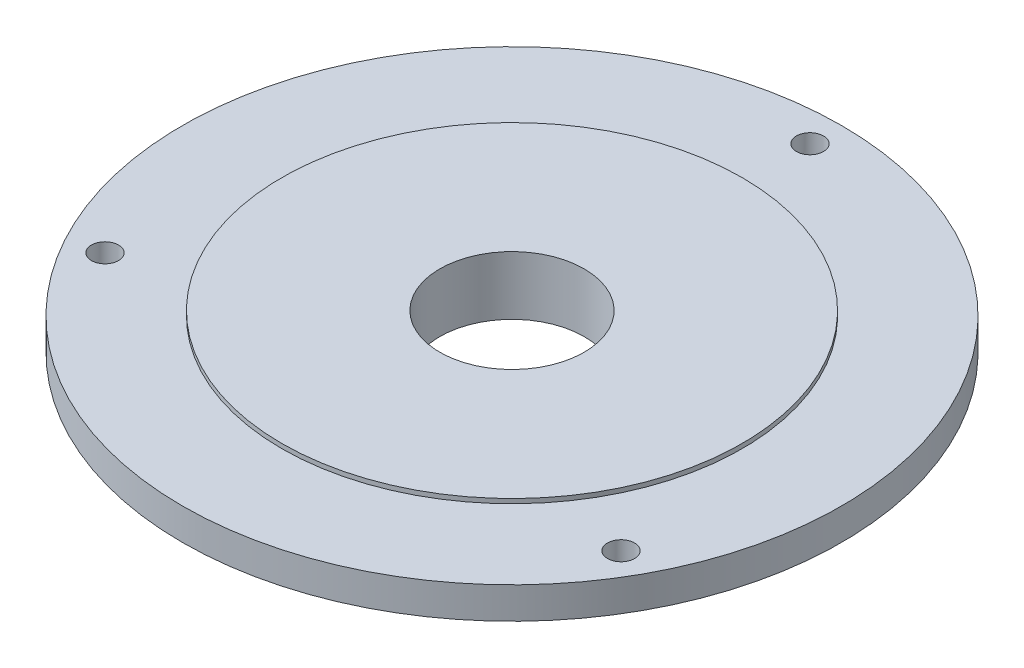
ISO-10303-21;
HEADER;
FILE_DESCRIPTION(('STEP AP214'),'2;1');
FILE_NAME('part.step','',(''),(''),'','','');
FILE_SCHEMA(('AUTOMOTIVE_DESIGN { 1 0 10303 214 1 1 1 1 }'));
ENDSEC;
DATA;
#1=APPLICATION_CONTEXT('core data for automotive mechanical design processes');
#2=APPLICATION_PROTOCOL_DEFINITION('international standard','automotive_design',2000,#1);
#3=PRODUCT_CONTEXT('',#1,'mechanical');
#4=PRODUCT('Part','Part','',(#3));
#5=PRODUCT_RELATED_PRODUCT_CATEGORY('part','',(#4));
#6=PRODUCT_DEFINITION_FORMATION('','',#4);
#7=PRODUCT_DEFINITION_CONTEXT('part definition',#1,'design');
#8=PRODUCT_DEFINITION('design','',#6,#7);
#9=PRODUCT_DEFINITION_SHAPE('','',#8);
#10=(LENGTH_UNIT() NAMED_UNIT(*) SI_UNIT(.MILLI.,.METRE.));
#11=(NAMED_UNIT(*) PLANE_ANGLE_UNIT() SI_UNIT($,.RADIAN.));
#12=(NAMED_UNIT(*) SI_UNIT($,.STERADIAN.) SOLID_ANGLE_UNIT());
#13=UNCERTAINTY_MEASURE_WITH_UNIT(LENGTH_MEASURE(1.E-05),#10,'distance_accuracy_value','');
#14=(GEOMETRIC_REPRESENTATION_CONTEXT(3) GLOBAL_UNCERTAINTY_ASSIGNED_CONTEXT((#13)) GLOBAL_UNIT_ASSIGNED_CONTEXT((#10,
#11,#12)) REPRESENTATION_CONTEXT('',''));
#15=CARTESIAN_POINT('',(0.,0.,0.));
#16=DIRECTION('',(0.,0.,1.));
#17=DIRECTION('',(1.,0.,0.));
#18=AXIS2_PLACEMENT_3D('',#15,#16,#17);
#19=CARTESIAN_POINT('',(0.,0.,0.));
#20=DIRECTION('',(0.,-1.,0.));
#21=DIRECTION('',(0.,0.,-1.));
#22=AXIS2_PLACEMENT_3D('',#19,#20,#21);
#23=CYLINDRICAL_SURFACE('',#22,25.5);
#24=CARTESIAN_POINT('',(0.,38.3859311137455,0.));
#25=DIRECTION('',(0.,-1.,0.));
#26=DIRECTION('',(0.,0.,-1.));
#27=AXIS2_PLACEMENT_3D('',#24,#25,#26);
#28=CIRCLE('',#27,25.5);
#29=CARTESIAN_POINT('',(0.,38.3859311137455,-25.5));
#30=VERTEX_POINT('',#29);
#31=EDGE_CURVE('E10',#30,#30,#28,.T.);
#32=ORIENTED_EDGE('',*,*,#31,.T.);
#33=EDGE_LOOP('',(#32));
#34=FACE_BOUND('',#33,.T.);
#35=CARTESIAN_POINT('',(0.,37.8859311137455,0.));
#36=DIRECTION('',(0.,-1.,0.));
#37=DIRECTION('',(0.,0.,-1.));
#38=AXIS2_PLACEMENT_3D('',#35,#36,#37);
#39=CIRCLE('',#38,25.5);
#40=CARTESIAN_POINT('',(0.,37.8859311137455,-25.5));
#41=VERTEX_POINT('',#40);
#42=EDGE_CURVE('E67',#41,#41,#39,.T.);
#43=ORIENTED_EDGE('',*,*,#42,.F.);
#44=EDGE_LOOP('',(#43));
#45=FACE_BOUND('',#44,.T.);
#46=ADVANCED_FACE('F39',(#34,#45),#23,.T.);
#47=CARTESIAN_POINT('',(8.,38.3859311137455,0.));
#48=DIRECTION('',(0.,1.,0.));
#49=DIRECTION('',(0.,0.,1.));
#50=AXIS2_PLACEMENT_3D('',#47,#48,#49);
#51=PLANE('',#50);
#52=CARTESIAN_POINT('',(0.,38.3859311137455,0.));
#53=DIRECTION('',(0.,-1.,0.));
#54=DIRECTION('',(0.,0.,-1.));
#55=AXIS2_PLACEMENT_3D('',#52,#53,#54);
#56=CIRCLE('',#55,8.);
#57=CARTESIAN_POINT('',(0.,38.3859311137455,-8.));
#58=VERTEX_POINT('',#57);
#59=EDGE_CURVE('E45',#58,#58,#56,.T.);
#60=ORIENTED_EDGE('',*,*,#59,.T.);
#61=EDGE_LOOP('',(#60));
#62=FACE_BOUND('',#61,.T.);
#63=ORIENTED_EDGE('',*,*,#31,.F.);
#64=EDGE_LOOP('',(#63));
#65=FACE_BOUND('',#64,.T.);
#66=ADVANCED_FACE('F132',(#62,#65),#51,.T.);
#67=CARTESIAN_POINT('',(0.,0.,0.));
#68=DIRECTION('',(0.,-1.,0.));
#69=DIRECTION('',(0.,0.,-1.));
#70=AXIS2_PLACEMENT_3D('',#67,#68,#69);
#71=CYLINDRICAL_SURFACE('',#70,8.);
#72=CARTESIAN_POINT('',(0.,31.8859311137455,0.));
#73=DIRECTION('',(0.,-1.,0.));
#74=DIRECTION('',(0.,0.,-1.));
#75=AXIS2_PLACEMENT_3D('',#72,#73,#74);
#76=CIRCLE('',#75,8.);
#77=CARTESIAN_POINT('',(0.,31.8859311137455,-8.));
#78=VERTEX_POINT('',#77);
#79=EDGE_CURVE('E49',#78,#78,#76,.T.);
#80=ORIENTED_EDGE('',*,*,#79,.T.);
#81=EDGE_LOOP('',(#80));
#82=FACE_BOUND('',#81,.T.);
#83=ORIENTED_EDGE('',*,*,#59,.F.);
#84=EDGE_LOOP('',(#83));
#85=FACE_BOUND('',#84,.T.);
#86=ADVANCED_FACE('F126',(#82,#85),#71,.F.);
#87=CARTESIAN_POINT('',(8.,31.8859311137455,0.));
#88=DIRECTION('',(0.,-1.,0.));
#89=DIRECTION('',(0.,0.,-1.));
#90=AXIS2_PLACEMENT_3D('',#87,#88,#89);
#91=PLANE('',#90);
#92=CARTESIAN_POINT('',(0.,31.8859311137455,0.));
#93=DIRECTION('',(0.,-1.,0.));
#94=DIRECTION('',(0.,0.,-1.));
#95=AXIS2_PLACEMENT_3D('',#92,#93,#94);
#96=CIRCLE('',#95,14.25);
#97=CARTESIAN_POINT('',(0.,31.8859311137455,-14.25));
#98=VERTEX_POINT('',#97);
#99=EDGE_CURVE('E53',#98,#98,#96,.T.);
#100=ORIENTED_EDGE('',*,*,#99,.T.);
#101=EDGE_LOOP('',(#100));
#102=FACE_BOUND('',#101,.T.);
#103=ORIENTED_EDGE('',*,*,#79,.F.);
#104=EDGE_LOOP('',(#103));
#105=FACE_BOUND('',#104,.T.);
#106=ADVANCED_FACE('F120',(#102,#105),#91,.T.);
#107=CARTESIAN_POINT('',(0.,0.,0.));
#108=DIRECTION('',(0.,-1.,0.));
#109=DIRECTION('',(0.,0.,-1.));
#110=AXIS2_PLACEMENT_3D('',#107,#108,#109);
#111=CYLINDRICAL_SURFACE('',#110,14.25);
#112=CARTESIAN_POINT('',(0.,34.3859311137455,0.));
#113=DIRECTION('',(0.,-1.,0.));
#114=DIRECTION('',(0.,0.,-1.));
#115=AXIS2_PLACEMENT_3D('',#112,#113,#114);
#116=CIRCLE('',#115,14.25);
#117=CARTESIAN_POINT('',(0.,34.3859311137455,-14.25));
#118=VERTEX_POINT('',#117);
#119=EDGE_CURVE('E58',#118,#118,#116,.T.);
#120=ORIENTED_EDGE('',*,*,#119,.T.);
#121=EDGE_LOOP('',(#120));
#122=FACE_BOUND('',#121,.T.);
#123=ORIENTED_EDGE('',*,*,#99,.F.);
#124=EDGE_LOOP('',(#123));
#125=FACE_BOUND('',#124,.T.);
#126=ADVANCED_FACE('F113',(#122,#125),#111,.T.);
#127=CARTESIAN_POINT('',(14.25,34.3859311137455,0.));
#128=DIRECTION('',(0.,-1.,0.));
#129=DIRECTION('',(0.,0.,-1.));
#130=AXIS2_PLACEMENT_3D('',#127,#128,#129);
#131=PLANE('',#130);
#132=CARTESIAN_POINT('',(0.,34.3859311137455,-33.));
#133=DIRECTION('',(0.,-1.,0.));
#134=DIRECTION('',(0.,0.,-1.));
#135=AXIS2_PLACEMENT_3D('',#132,#133,#134);
#136=CIRCLE('',#135,1.5);
#137=CARTESIAN_POINT('',(0.,34.3859311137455,-34.5));
#138=VERTEX_POINT('',#137);
#139=EDGE_CURVE('E70',#138,#138,#136,.T.);
#140=ORIENTED_EDGE('',*,*,#139,.F.);
#141=EDGE_LOOP('',(#140));
#142=FACE_BOUND('',#141,.T.);
#143=CARTESIAN_POINT('',(28.5788383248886,34.3859311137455,16.4999999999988));
#144=DIRECTION('',(0.,-1.,0.));
#145=DIRECTION('',(0.,0.,-1.));
#146=AXIS2_PLACEMENT_3D('',#143,#144,#145);
#147=CIRCLE('',#146,1.5000000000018);
#148=CARTESIAN_POINT('',(28.5788383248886,34.3859311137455,14.999999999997));
#149=VERTEX_POINT('',#148);
#150=EDGE_CURVE('E73',#149,#149,#147,.T.);
#151=ORIENTED_EDGE('',*,*,#150,.F.);
#152=EDGE_LOOP('',(#151));
#153=FACE_BOUND('',#152,.T.);
#154=CARTESIAN_POINT('',(-28.5788383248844,34.3859311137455,16.5000000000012));
#155=DIRECTION('',(0.,-1.,0.));
#156=DIRECTION('',(0.,0.,-1.));
#157=AXIS2_PLACEMENT_3D('',#154,#155,#156);
#158=CIRCLE('',#157,1.50000000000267);
#159=CARTESIAN_POINT('',(-28.5788383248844,34.3859311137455,14.9999999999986));
#160=VERTEX_POINT('',#159);
#161=EDGE_CURVE('E76',#160,#160,#158,.T.);
#162=ORIENTED_EDGE('',*,*,#161,.F.);
#163=EDGE_LOOP('',(#162));
#164=FACE_BOUND('',#163,.T.);
#165=CARTESIAN_POINT('',(0.,34.3859311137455,0.));
#166=DIRECTION('',(0.,-1.,0.));
#167=DIRECTION('',(0.,0.,-1.));
#168=AXIS2_PLACEMENT_3D('',#165,#166,#167);
#169=CIRCLE('',#168,36.5);
#170=CARTESIAN_POINT('',(0.,34.3859311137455,-36.5));
#171=VERTEX_POINT('',#170);
#172=EDGE_CURVE('E61',#171,#171,#169,.T.);
#173=ORIENTED_EDGE('',*,*,#172,.T.);
#174=EDGE_LOOP('',(#173));
#175=FACE_BOUND('',#174,.T.);
#176=ORIENTED_EDGE('',*,*,#119,.F.);
#177=EDGE_LOOP('',(#176));
#178=FACE_BOUND('',#177,.T.);
#179=ADVANCED_FACE('F107',(#142,#153,#164,#175,#178),#131,.T.);
#180=CARTESIAN_POINT('',(0.,0.,0.));
#181=DIRECTION('',(0.,-1.,0.));
#182=DIRECTION('',(0.,0.,-1.));
#183=AXIS2_PLACEMENT_3D('',#180,#181,#182);
#184=CYLINDRICAL_SURFACE('',#183,36.5);
#185=CARTESIAN_POINT('',(0.,37.8859311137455,0.));
#186=DIRECTION('',(0.,-1.,0.));
#187=DIRECTION('',(0.,0.,-1.));
#188=AXIS2_PLACEMENT_3D('',#185,#186,#187);
#189=CIRCLE('',#188,36.5);
#190=CARTESIAN_POINT('',(0.,37.8859311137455,-36.5));
#191=VERTEX_POINT('',#190);
#192=EDGE_CURVE('E64',#191,#191,#189,.T.);
#193=ORIENTED_EDGE('',*,*,#192,.T.);
#194=EDGE_LOOP('',(#193));
#195=FACE_BOUND('',#194,.T.);
#196=ORIENTED_EDGE('',*,*,#172,.F.);
#197=EDGE_LOOP('',(#196));
#198=FACE_BOUND('',#197,.T.);
#199=ADVANCED_FACE('F95',(#195,#198),#184,.T.);
#200=CARTESIAN_POINT('',(25.5,37.8859311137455,0.));
#201=DIRECTION('',(0.,1.,0.));
#202=DIRECTION('',(0.,0.,1.));
#203=AXIS2_PLACEMENT_3D('',#200,#201,#202);
#204=PLANE('',#203);
#205=CARTESIAN_POINT('',(0.,37.8859311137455,-33.));
#206=DIRECTION('',(0.,1.,0.));
#207=DIRECTION('',(0.,0.,1.));
#208=AXIS2_PLACEMENT_3D('',#205,#206,#207);
#209=CIRCLE('',#208,1.5);
#210=CARTESIAN_POINT('',(0.,37.8859311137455,-31.5));
#211=VERTEX_POINT('',#210);
#212=EDGE_CURVE('E79',#211,#211,#209,.T.);
#213=ORIENTED_EDGE('',*,*,#212,.F.);
#214=EDGE_LOOP('',(#213));
#215=FACE_BOUND('',#214,.T.);
#216=CARTESIAN_POINT('',(28.5788383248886,37.8859311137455,16.4999999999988));
#217=DIRECTION('',(0.,1.,0.));
#218=DIRECTION('',(0.,0.,1.));
#219=AXIS2_PLACEMENT_3D('',#216,#217,#218);
#220=CIRCLE('',#219,1.5000000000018);
#221=CARTESIAN_POINT('',(28.5788383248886,37.8859311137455,18.0000000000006));
#222=VERTEX_POINT('',#221);
#223=EDGE_CURVE('E83',#222,#222,#220,.T.);
#224=ORIENTED_EDGE('',*,*,#223,.F.);
#225=EDGE_LOOP('',(#224));
#226=FACE_BOUND('',#225,.T.);
#227=CARTESIAN_POINT('',(-28.5788383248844,37.8859311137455,16.5000000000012));
#228=DIRECTION('',(0.,1.,0.));
#229=DIRECTION('',(0.,0.,1.));
#230=AXIS2_PLACEMENT_3D('',#227,#228,#229);
#231=CIRCLE('',#230,1.50000000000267);
#232=CARTESIAN_POINT('',(-28.5788383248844,37.8859311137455,18.0000000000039));
#233=VERTEX_POINT('',#232);
#234=EDGE_CURVE('E80',#233,#233,#231,.T.);
#235=ORIENTED_EDGE('',*,*,#234,.F.);
#236=EDGE_LOOP('',(#235));
#237=FACE_BOUND('',#236,.T.);
#238=ORIENTED_EDGE('',*,*,#42,.T.);
#239=EDGE_LOOP('',(#238));
#240=FACE_BOUND('',#239,.T.);
#241=ORIENTED_EDGE('',*,*,#192,.F.);
#242=EDGE_LOOP('',(#241));
#243=FACE_BOUND('',#242,.T.);
#244=ADVANCED_FACE('F91',(#215,#226,#237,#240,#243),#204,.T.);
#245=CARTESIAN_POINT('',(-28.5788383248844,31.8859311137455,16.5000000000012));
#246=DIRECTION('',(0.,1.,0.));
#247=DIRECTION('',(0.,0.,1.));
#248=AXIS2_PLACEMENT_3D('',#245,#246,#247);
#249=CYLINDRICAL_SURFACE('',#248,1.50000000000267);
#250=ORIENTED_EDGE('',*,*,#161,.T.);
#251=EDGE_LOOP('',(#250));
#252=FACE_BOUND('',#251,.T.);
#253=ORIENTED_EDGE('',*,*,#234,.T.);
#254=EDGE_LOOP('',(#253));
#255=FACE_BOUND('',#254,.T.);
#256=ADVANCED_FACE('F94',(#252,#255),#249,.F.);
#257=CARTESIAN_POINT('',(28.5788383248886,31.8859311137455,16.4999999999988));
#258=DIRECTION('',(0.,1.,0.));
#259=DIRECTION('',(0.,0.,1.));
#260=AXIS2_PLACEMENT_3D('',#257,#258,#259);
#261=CYLINDRICAL_SURFACE('',#260,1.5000000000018);
#262=ORIENTED_EDGE('',*,*,#150,.T.);
#263=EDGE_LOOP('',(#262));
#264=FACE_BOUND('',#263,.T.);
#265=ORIENTED_EDGE('',*,*,#223,.T.);
#266=EDGE_LOOP('',(#265));
#267=FACE_BOUND('',#266,.T.);
#268=ADVANCED_FACE('F188',(#264,#267),#261,.F.);
#269=CARTESIAN_POINT('',(0.,31.8859311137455,-33.));
#270=DIRECTION('',(0.,1.,0.));
#271=DIRECTION('',(0.,0.,1.));
#272=AXIS2_PLACEMENT_3D('',#269,#270,#271);
#273=CYLINDRICAL_SURFACE('',#272,1.5);
#274=ORIENTED_EDGE('',*,*,#139,.T.);
#275=EDGE_LOOP('',(#274));
#276=FACE_BOUND('',#275,.T.);
#277=ORIENTED_EDGE('',*,*,#212,.T.);
#278=EDGE_LOOP('',(#277));
#279=FACE_BOUND('',#278,.T.);
#280=ADVANCED_FACE('F89',(#276,#279),#273,.F.);
#281=CLOSED_SHELL('',(#46,#66,#86,#106,#126,#179,#199,#244,#256,#268,#280));
#282=MANIFOLD_SOLID_BREP('B2',#281);
#283=ADVANCED_BREP_SHAPE_REPRESENTATION('',(#18,#282),#14);
#284=SHAPE_DEFINITION_REPRESENTATION(#9,#283);
ENDSEC;
END-ISO-10303-21;
